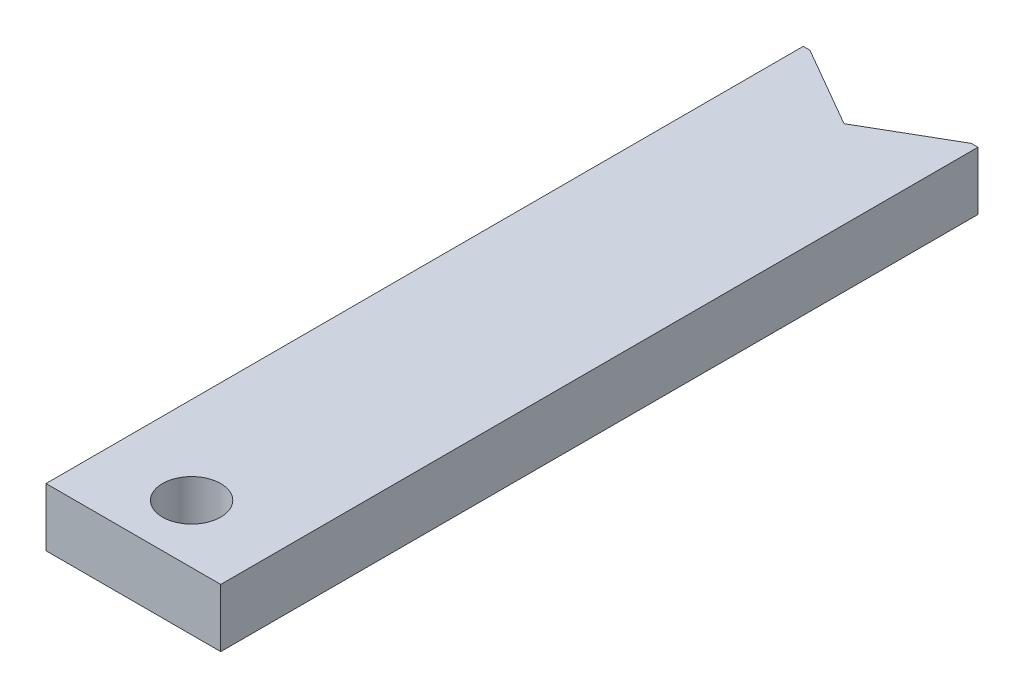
ISO-10303-21;
HEADER;
FILE_DESCRIPTION(('STEP AP214'),'2;1');
FILE_NAME('part.step','',(''),(''),'','','');
FILE_SCHEMA(('AUTOMOTIVE_DESIGN { 1 0 10303 214 1 1 1 1 }'));
ENDSEC;
DATA;
#1=APPLICATION_CONTEXT('core data for automotive mechanical design processes');
#2=APPLICATION_PROTOCOL_DEFINITION('international standard','automotive_design',2000,#1);
#3=PRODUCT_CONTEXT('',#1,'mechanical');
#4=PRODUCT('Part','Part','',(#3));
#5=PRODUCT_RELATED_PRODUCT_CATEGORY('part','',(#4));
#6=PRODUCT_DEFINITION_FORMATION('','',#4);
#7=PRODUCT_DEFINITION_CONTEXT('part definition',#1,'design');
#8=PRODUCT_DEFINITION('design','',#6,#7);
#9=PRODUCT_DEFINITION_SHAPE('','',#8);
#10=(LENGTH_UNIT() NAMED_UNIT(*) SI_UNIT(.MILLI.,.METRE.));
#11=(NAMED_UNIT(*) PLANE_ANGLE_UNIT() SI_UNIT($,.RADIAN.));
#12=(NAMED_UNIT(*) SI_UNIT($,.STERADIAN.) SOLID_ANGLE_UNIT());
#13=UNCERTAINTY_MEASURE_WITH_UNIT(LENGTH_MEASURE(1.E-05),#10,'distance_accuracy_value','');
#14=(GEOMETRIC_REPRESENTATION_CONTEXT(3) GLOBAL_UNCERTAINTY_ASSIGNED_CONTEXT((#13)) GLOBAL_UNIT_ASSIGNED_CONTEXT((#10,
#11,#12)) REPRESENTATION_CONTEXT('',''));
#15=CARTESIAN_POINT('',(0.,0.,0.));
#16=DIRECTION('',(0.,0.,1.));
#17=DIRECTION('',(1.,0.,0.));
#18=AXIS2_PLACEMENT_3D('',#15,#16,#17);
#19=CARTESIAN_POINT('',(-7.50000000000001,5.,-32.5));
#20=DIRECTION('',(0.,0.,1.));
#21=DIRECTION('',(1.,0.,0.));
#22=AXIS2_PLACEMENT_3D('',#19,#20,#21);
#23=PLANE('',#22);
#24=DIRECTION('',(0.,1.,0.));
#25=VECTOR('',#24,1.);
#26=CARTESIAN_POINT('',(-6.92820323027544,0.,-32.5));
#27=LINE('',#26,#25);
#28=CARTESIAN_POINT('',(-6.92820323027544,5.,-32.5));
#29=VERTEX_POINT('',#28);
#30=CARTESIAN_POINT('',(-6.92820323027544,0.,-32.5));
#31=VERTEX_POINT('',#30);
#32=EDGE_CURVE('E71',#29,#31,#27,.F.);
#33=ORIENTED_EDGE('',*,*,#32,.T.);
#34=DIRECTION('',(1.,0.,0.));
#35=VECTOR('',#34,1.);
#36=CARTESIAN_POINT('',(0.,0.,-32.5));
#37=LINE('',#36,#35);
#38=CARTESIAN_POINT('',(-7.50000000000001,0.,-32.5));
#39=VERTEX_POINT('',#38);
#40=EDGE_CURVE('E85',#31,#39,#37,.F.);
#41=ORIENTED_EDGE('',*,*,#40,.T.);
#42=DIRECTION('',(0.,1.,0.));
#43=VECTOR('',#42,1.);
#44=CARTESIAN_POINT('',(-7.50000000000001,5.,-32.5));
#45=LINE('',#44,#43);
#46=CARTESIAN_POINT('',(-7.50000000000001,5.,-32.5));
#47=VERTEX_POINT('',#46);
#48=EDGE_CURVE('E128',#39,#47,#45,.T.);
#49=ORIENTED_EDGE('',*,*,#48,.T.);
#50=DIRECTION('',(1.,0.,0.));
#51=VECTOR('',#50,1.);
#52=CARTESIAN_POINT('',(-7.50000000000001,5.,-32.5));
#53=LINE('',#52,#51);
#54=EDGE_CURVE('E105',#29,#47,#53,.F.);
#55=ORIENTED_EDGE('',*,*,#54,.F.);
#56=EDGE_LOOP('',(#33,#41,#49,#55));
#57=FACE_BOUND('',#56,.T.);
#58=ADVANCED_FACE('F17',(#57),#23,.F.);
#59=CARTESIAN_POINT('',(-7.50000000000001,5.,-32.5));
#60=DIRECTION('',(0.,0.,1.));
#61=DIRECTION('',(1.,0.,0.));
#62=AXIS2_PLACEMENT_3D('',#59,#60,#61);
#63=PLANE('',#62);
#64=DIRECTION('',(0.,1.,0.));
#65=VECTOR('',#64,1.);
#66=CARTESIAN_POINT('',(6.92820323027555,0.,-32.5));
#67=LINE('',#66,#65);
#68=CARTESIAN_POINT('',(6.92820323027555,0.,-32.5));
#69=VERTEX_POINT('',#68);
#70=CARTESIAN_POINT('',(6.92820323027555,5.,-32.5));
#71=VERTEX_POINT('',#70);
#72=EDGE_CURVE('E79',#69,#71,#67,.T.);
#73=ORIENTED_EDGE('',*,*,#72,.T.);
#74=DIRECTION('',(1.,0.,0.));
#75=VECTOR('',#74,1.);
#76=CARTESIAN_POINT('',(-7.50000000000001,5.,-32.5));
#77=LINE('',#76,#75);
#78=CARTESIAN_POINT('',(7.5,5.,-32.5));
#79=VERTEX_POINT('',#78);
#80=EDGE_CURVE('E35',#79,#71,#77,.F.);
#81=ORIENTED_EDGE('',*,*,#80,.F.);
#82=DIRECTION('',(0.,1.,0.));
#83=VECTOR('',#82,1.);
#84=CARTESIAN_POINT('',(7.49999999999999,5.,-32.5));
#85=LINE('',#84,#83);
#86=CARTESIAN_POINT('',(7.5,0.,-32.5));
#87=VERTEX_POINT('',#86);
#88=EDGE_CURVE('E81',#79,#87,#85,.F.);
#89=ORIENTED_EDGE('',*,*,#88,.T.);
#90=DIRECTION('',(1.,0.,0.));
#91=VECTOR('',#90,1.);
#92=CARTESIAN_POINT('',(0.,0.,-32.5));
#93=LINE('',#92,#91);
#94=EDGE_CURVE('E75',#87,#69,#93,.F.);
#95=ORIENTED_EDGE('',*,*,#94,.T.);
#96=EDGE_LOOP('',(#73,#81,#89,#95));
#97=FACE_BOUND('',#96,.T.);
#98=ADVANCED_FACE('F77',(#97),#63,.F.);
#99=CARTESIAN_POINT('',(0.,0.,0.));
#100=DIRECTION('',(0.,1.,0.));
#101=DIRECTION('',(0.,0.,1.));
#102=AXIS2_PLACEMENT_3D('',#99,#100,#101);
#103=PLANE('',#102);
#104=DIRECTION('',(0.86602540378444,0.,-0.499999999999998));
#105=VECTOR('',#104,1.);
#106=CARTESIAN_POINT('',(0.,0.,-28.5));
#107=LINE('',#106,#105);
#108=CARTESIAN_POINT('',(0.,0.,-28.5));
#109=VERTEX_POINT('',#108);
#110=EDGE_CURVE('E88',#109,#69,#107,.T.);
#111=ORIENTED_EDGE('',*,*,#110,.T.);
#112=ORIENTED_EDGE('',*,*,#94,.F.);
#113=DIRECTION('',(0.,0.,1.));
#114=VECTOR('',#113,1.);
#115=CARTESIAN_POINT('',(7.49999999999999,0.,-32.5));
#116=LINE('',#115,#114);
#117=CARTESIAN_POINT('',(7.5,0.,32.5));
#118=VERTEX_POINT('',#117);
#119=EDGE_CURVE('E108',#87,#118,#116,.T.);
#120=ORIENTED_EDGE('',*,*,#119,.T.);
#121=DIRECTION('',(-1.,0.,0.));
#122=VECTOR('',#121,1.);
#123=CARTESIAN_POINT('',(-7.5,0.,32.5));
#124=LINE('',#123,#122);
#125=CARTESIAN_POINT('',(-7.5,0.,32.5));
#126=VERTEX_POINT('',#125);
#127=EDGE_CURVE('E121',#118,#126,#124,.T.);
#128=ORIENTED_EDGE('',*,*,#127,.T.);
#129=DIRECTION('',(0.,0.,-1.));
#130=VECTOR('',#129,1.);
#131=CARTESIAN_POINT('',(-7.50000000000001,0.,-32.5));
#132=LINE('',#131,#130);
#133=EDGE_CURVE('E125',#126,#39,#132,.T.);
#134=ORIENTED_EDGE('',*,*,#133,.T.);
#135=ORIENTED_EDGE('',*,*,#40,.F.);
#136=DIRECTION('',(0.866025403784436,0.,0.500000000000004));
#137=VECTOR('',#136,1.);
#138=CARTESIAN_POINT('',(-6.92820323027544,0.,-32.5));
#139=LINE('',#138,#137);
#140=EDGE_CURVE('E92',#31,#109,#139,.T.);
#141=ORIENTED_EDGE('',*,*,#140,.T.);
#142=EDGE_LOOP('',(#111,#112,#120,#128,#134,#135,#141));
#143=FACE_BOUND('',#142,.T.);
#144=CARTESIAN_POINT('',(0.,0.,27.5));
#145=DIRECTION('',(0.,1.,0.));
#146=DIRECTION('',(0.,0.,1.));
#147=AXIS2_PLACEMENT_3D('',#144,#145,#146);
#148=CIRCLE('',#147,2.5);
#149=CARTESIAN_POINT('',(0.,0.,30.));
#150=VERTEX_POINT('',#149);
#151=EDGE_CURVE('E20',#150,#150,#148,.T.);
#152=ORIENTED_EDGE('',*,*,#151,.T.);
#153=EDGE_LOOP('',(#152));
#154=FACE_BOUND('',#153,.T.);
#155=ADVANCED_FACE('F89',(#143,#154),#103,.F.);
#156=CARTESIAN_POINT('',(0.,0.,27.5));
#157=DIRECTION('',(0.,1.,0.));
#158=DIRECTION('',(0.,0.,1.));
#159=AXIS2_PLACEMENT_3D('',#156,#157,#158);
#160=CYLINDRICAL_SURFACE('',#159,2.5);
#161=CARTESIAN_POINT('',(0.,5.,27.5));
#162=DIRECTION('',(0.,1.,0.));
#163=DIRECTION('',(0.,0.,1.));
#164=AXIS2_PLACEMENT_3D('',#161,#162,#163);
#165=CIRCLE('',#164,2.5);
#166=CARTESIAN_POINT('',(0.,5.,30.));
#167=VERTEX_POINT('',#166);
#168=EDGE_CURVE('E106',#167,#167,#165,.F.);
#169=ORIENTED_EDGE('',*,*,#168,.F.);
#170=EDGE_LOOP('',(#169));
#171=FACE_BOUND('',#170,.T.);
#172=ORIENTED_EDGE('',*,*,#151,.F.);
#173=EDGE_LOOP('',(#172));
#174=FACE_BOUND('',#173,.T.);
#175=ADVANCED_FACE('F174',(#171,#174),#160,.F.);
#176=CARTESIAN_POINT('',(0.,0.,-28.5));
#177=DIRECTION('',(0.499999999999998,0.,0.86602540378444));
#178=DIRECTION('',(0.86602540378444,0.,-0.499999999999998));
#179=AXIS2_PLACEMENT_3D('',#176,#177,#178);
#180=PLANE('',#179);
#181=ORIENTED_EDGE('',*,*,#72,.F.);
#182=ORIENTED_EDGE('',*,*,#110,.F.);
#183=DIRECTION('',(0.,1.,0.));
#184=VECTOR('',#183,1.);
#185=CARTESIAN_POINT('',(0.,0.,-28.5));
#186=LINE('',#185,#184);
#187=CARTESIAN_POINT('',(0.,5.,-28.5));
#188=VERTEX_POINT('',#187);
#189=EDGE_CURVE('E131',#109,#188,#186,.T.);
#190=ORIENTED_EDGE('',*,*,#189,.T.);
#191=DIRECTION('',(-0.86602540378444,0.,0.499999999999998));
#192=VECTOR('',#191,1.);
#193=CARTESIAN_POINT('',(6.92820323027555,5.,-32.5));
#194=LINE('',#193,#192);
#195=EDGE_CURVE('E98',#71,#188,#194,.T.);
#196=ORIENTED_EDGE('',*,*,#195,.F.);
#197=EDGE_LOOP('',(#181,#182,#190,#196));
#198=FACE_BOUND('',#197,.T.);
#199=ADVANCED_FACE('F96',(#198),#180,.F.);
#200=CARTESIAN_POINT('',(-6.92820323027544,0.,-32.5));
#201=DIRECTION('',(-0.500000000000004,0.,0.866025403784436));
#202=DIRECTION('',(0.866025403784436,0.,0.500000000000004));
#203=AXIS2_PLACEMENT_3D('',#200,#201,#202);
#204=PLANE('',#203);
#205=ORIENTED_EDGE('',*,*,#189,.F.);
#206=ORIENTED_EDGE('',*,*,#140,.F.);
#207=ORIENTED_EDGE('',*,*,#32,.F.);
#208=DIRECTION('',(-0.866025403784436,0.,-0.500000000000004));
#209=VECTOR('',#208,1.);
#210=CARTESIAN_POINT('',(0.,5.,-28.5));
#211=LINE('',#210,#209);
#212=EDGE_CURVE('E111',#188,#29,#211,.T.);
#213=ORIENTED_EDGE('',*,*,#212,.F.);
#214=EDGE_LOOP('',(#205,#206,#207,#213));
#215=FACE_BOUND('',#214,.T.);
#216=ADVANCED_FACE('F135',(#215),#204,.F.);
#217=CARTESIAN_POINT('',(-7.50000000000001,5.,-32.5));
#218=DIRECTION('',(1.,0.,0.));
#219=DIRECTION('',(0.,0.,-1.));
#220=AXIS2_PLACEMENT_3D('',#217,#218,#219);
#221=PLANE('',#220);
#222=DIRECTION('',(0.,1.,0.));
#223=VECTOR('',#222,1.);
#224=CARTESIAN_POINT('',(-7.5,5.,32.5));
#225=LINE('',#224,#223);
#226=CARTESIAN_POINT('',(-7.5,5.,32.5));
#227=VERTEX_POINT('',#226);
#228=EDGE_CURVE('E123',#126,#227,#225,.T.);
#229=ORIENTED_EDGE('',*,*,#228,.T.);
#230=DIRECTION('',(0.,0.,1.));
#231=VECTOR('',#230,1.);
#232=CARTESIAN_POINT('',(-7.50000000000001,5.,0.));
#233=LINE('',#232,#231);
#234=EDGE_CURVE('E137',#47,#227,#233,.T.);
#235=ORIENTED_EDGE('',*,*,#234,.F.);
#236=ORIENTED_EDGE('',*,*,#48,.F.);
#237=ORIENTED_EDGE('',*,*,#133,.F.);
#238=EDGE_LOOP('',(#229,#235,#236,#237));
#239=FACE_BOUND('',#238,.T.);
#240=ADVANCED_FACE('F151',(#239),#221,.F.);
#241=CARTESIAN_POINT('',(-7.5,5.,32.5));
#242=DIRECTION('',(0.,0.,-1.));
#243=DIRECTION('',(-1.,0.,0.));
#244=AXIS2_PLACEMENT_3D('',#241,#242,#243);
#245=PLANE('',#244);
#246=DIRECTION('',(0.,1.,0.));
#247=VECTOR('',#246,1.);
#248=CARTESIAN_POINT('',(7.5,5.,32.5));
#249=LINE('',#248,#247);
#250=CARTESIAN_POINT('',(7.5,5.,32.5));
#251=VERTEX_POINT('',#250);
#252=EDGE_CURVE('E116',#118,#251,#249,.T.);
#253=ORIENTED_EDGE('',*,*,#252,.T.);
#254=DIRECTION('',(1.,0.,0.));
#255=VECTOR('',#254,1.);
#256=CARTESIAN_POINT('',(0.,5.,32.5));
#257=LINE('',#256,#255);
#258=EDGE_CURVE('E26',#227,#251,#257,.T.);
#259=ORIENTED_EDGE('',*,*,#258,.F.);
#260=ORIENTED_EDGE('',*,*,#228,.F.);
#261=ORIENTED_EDGE('',*,*,#127,.F.);
#262=EDGE_LOOP('',(#253,#259,#260,#261));
#263=FACE_BOUND('',#262,.T.);
#264=ADVANCED_FACE('F146',(#263),#245,.F.);
#265=CARTESIAN_POINT('',(7.49999999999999,5.,-32.5));
#266=DIRECTION('',(-1.,0.,0.));
#267=DIRECTION('',(0.,0.,1.));
#268=AXIS2_PLACEMENT_3D('',#265,#266,#267);
#269=PLANE('',#268);
#270=ORIENTED_EDGE('',*,*,#88,.F.);
#271=DIRECTION('',(0.,0.,1.));
#272=VECTOR('',#271,1.);
#273=CARTESIAN_POINT('',(7.5,5.,0.));
#274=LINE('',#273,#272);
#275=EDGE_CURVE('E11',#251,#79,#274,.F.);
#276=ORIENTED_EDGE('',*,*,#275,.F.);
#277=ORIENTED_EDGE('',*,*,#252,.F.);
#278=ORIENTED_EDGE('',*,*,#119,.F.);
#279=EDGE_LOOP('',(#270,#276,#277,#278));
#280=FACE_BOUND('',#279,.T.);
#281=ADVANCED_FACE('F144',(#280),#269,.F.);
#282=CARTESIAN_POINT('',(0.,5.,0.));
#283=DIRECTION('',(0.,1.,0.));
#284=DIRECTION('',(0.,0.,1.));
#285=AXIS2_PLACEMENT_3D('',#282,#283,#284);
#286=PLANE('',#285);
#287=ORIENTED_EDGE('',*,*,#275,.T.);
#288=ORIENTED_EDGE('',*,*,#80,.T.);
#289=ORIENTED_EDGE('',*,*,#195,.T.);
#290=ORIENTED_EDGE('',*,*,#212,.T.);
#291=ORIENTED_EDGE('',*,*,#54,.T.);
#292=ORIENTED_EDGE('',*,*,#234,.T.);
#293=ORIENTED_EDGE('',*,*,#258,.T.);
#294=EDGE_LOOP('',(#287,#288,#289,#290,#291,#292,#293));
#295=FACE_BOUND('',#294,.T.);
#296=ORIENTED_EDGE('',*,*,#168,.T.);
#297=EDGE_LOOP('',(#296));
#298=FACE_BOUND('',#297,.T.);
#299=ADVANCED_FACE('F138',(#295,#298),#286,.T.);
#300=CLOSED_SHELL('',(#58,#98,#155,#175,#199,#216,#240,#264,#281,#299));
#301=MANIFOLD_SOLID_BREP('B1',#300);
#302=ADVANCED_BREP_SHAPE_REPRESENTATION('',(#18,#301),#14);
#303=SHAPE_DEFINITION_REPRESENTATION(#9,#302);
ENDSEC;
END-ISO-10303-21;
